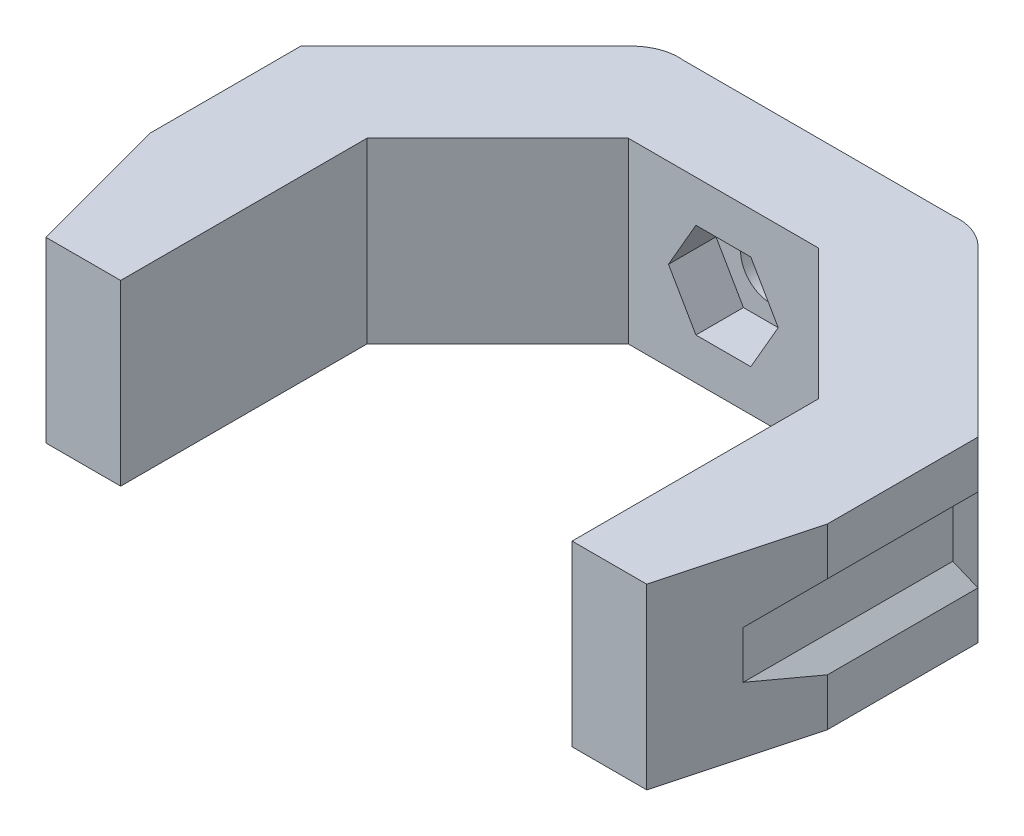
ISO-10303-21;
HEADER;
FILE_DESCRIPTION(('STEP AP214'),'2;1');
FILE_NAME('part.step','',(''),(''),'','','');
FILE_SCHEMA(('AUTOMOTIVE_DESIGN { 1 0 10303 214 1 1 1 1 }'));
ENDSEC;
DATA;
#1=APPLICATION_CONTEXT('core data for automotive mechanical design processes');
#2=APPLICATION_PROTOCOL_DEFINITION('international standard','automotive_design',2000,#1);
#3=PRODUCT_CONTEXT('',#1,'mechanical');
#4=PRODUCT('Part','Part','',(#3));
#5=PRODUCT_RELATED_PRODUCT_CATEGORY('part','',(#4));
#6=PRODUCT_DEFINITION_FORMATION('','',#4);
#7=PRODUCT_DEFINITION_CONTEXT('part definition',#1,'design');
#8=PRODUCT_DEFINITION('design','',#6,#7);
#9=PRODUCT_DEFINITION_SHAPE('','',#8);
#10=(LENGTH_UNIT() NAMED_UNIT(*) SI_UNIT(.MILLI.,.METRE.));
#11=(NAMED_UNIT(*) PLANE_ANGLE_UNIT() SI_UNIT($,.RADIAN.));
#12=(NAMED_UNIT(*) SI_UNIT($,.STERADIAN.) SOLID_ANGLE_UNIT());
#13=UNCERTAINTY_MEASURE_WITH_UNIT(LENGTH_MEASURE(1.E-05),#10,'distance_accuracy_value','');
#14=(GEOMETRIC_REPRESENTATION_CONTEXT(3) GLOBAL_UNCERTAINTY_ASSIGNED_CONTEXT((#13)) GLOBAL_UNIT_ASSIGNED_CONTEXT((#10,
#11,#12)) REPRESENTATION_CONTEXT('',''));
#15=CARTESIAN_POINT('',(0.,0.,0.));
#16=DIRECTION('',(0.,0.,1.));
#17=DIRECTION('',(1.,0.,0.));
#18=AXIS2_PLACEMENT_3D('',#15,#16,#17);
#19=CARTESIAN_POINT('',(46.,15.,0.));
#20=DIRECTION('',(-1.,0.,0.));
#21=DIRECTION('',(0.,0.,1.));
#22=AXIS2_PLACEMENT_3D('',#19,#20,#21);
#23=PLANE('',#22);
#24=DIRECTION('',(0.,-1.,0.));
#25=VECTOR('',#24,1.);
#26=CARTESIAN_POINT('',(46.,-0.001000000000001,-6.40192378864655));
#27=LINE('',#26,#25);
#28=CARTESIAN_POINT('',(46.,9.5,-6.40192378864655));
#29=VERTEX_POINT('',#28);
#30=CARTESIAN_POINT('',(46.,5.5,-6.40192378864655));
#31=VERTEX_POINT('',#30);
#32=EDGE_CURVE('E280',#29,#31,#27,.T.);
#33=ORIENTED_EDGE('',*,*,#32,.T.);
#34=DIRECTION('',(0.,0.,-1.));
#35=VECTOR('',#34,1.);
#36=CARTESIAN_POINT('',(46.,5.5,0.));
#37=LINE('',#36,#35);
#38=CARTESIAN_POINT('',(46.,5.5,-24.0482473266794));
#39=VERTEX_POINT('',#38);
#40=EDGE_CURVE('E743',#31,#39,#37,.T.);
#41=ORIENTED_EDGE('',*,*,#40,.T.);
#42=DIRECTION('',(0.,-1.,0.));
#43=VECTOR('',#42,1.);
#44=CARTESIAN_POINT('',(46.,15.,-24.0482473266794));
#45=LINE('',#44,#43);
#46=CARTESIAN_POINT('',(46.,9.5,-24.0482473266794));
#47=VERTEX_POINT('',#46);
#48=EDGE_CURVE('E522',#47,#39,#45,.T.);
#49=ORIENTED_EDGE('',*,*,#48,.F.);
#50=DIRECTION('',(0.,0.,-1.));
#51=VECTOR('',#50,1.);
#52=CARTESIAN_POINT('',(46.,9.5,0.));
#53=LINE('',#52,#51);
#54=EDGE_CURVE('E303',#29,#47,#53,.T.);
#55=ORIENTED_EDGE('',*,*,#54,.F.);
#56=EDGE_LOOP('',(#33,#41,#49,#55));
#57=FACE_BOUND('',#56,.T.);
#58=ADVANCED_FACE('F43',(#57),#23,.F.);
#59=CARTESIAN_POINT('',(38.,15.,0.));
#60=DIRECTION('',(0.,0.,-1.));
#61=DIRECTION('',(-1.,0.,0.));
#62=AXIS2_PLACEMENT_3D('',#59,#60,#61);
#63=PLANE('',#62);
#64=DIRECTION('',(0.,1.,0.));
#65=VECTOR('',#64,1.);
#66=CARTESIAN_POINT('',(44.2846096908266,-0.001000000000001,0.));
#67=LINE('',#66,#65);
#68=CARTESIAN_POINT('',(44.2846096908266,0.,0.));
#69=VERTEX_POINT('',#68);
#70=CARTESIAN_POINT('',(44.2846096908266,15.,0.));
#71=VERTEX_POINT('',#70);
#72=EDGE_CURVE('E714',#69,#71,#67,.T.);
#73=ORIENTED_EDGE('',*,*,#72,.T.);
#74=DIRECTION('',(1.,0.,0.));
#75=VECTOR('',#74,1.);
#76=CARTESIAN_POINT('',(38.,15.,0.));
#77=LINE('',#76,#75);
#78=CARTESIAN_POINT('',(38.,15.,0.));
#79=VERTEX_POINT('',#78);
#80=EDGE_CURVE('E490',#79,#71,#77,.T.);
#81=ORIENTED_EDGE('',*,*,#80,.F.);
#82=DIRECTION('',(0.,-1.,0.));
#83=VECTOR('',#82,1.);
#84=CARTESIAN_POINT('',(38.,15.,0.));
#85=LINE('',#84,#83);
#86=CARTESIAN_POINT('',(38.,0.,0.));
#87=VERTEX_POINT('',#86);
#88=EDGE_CURVE('E526',#79,#87,#85,.T.);
#89=ORIENTED_EDGE('',*,*,#88,.T.);
#90=DIRECTION('',(1.,0.,0.));
#91=VECTOR('',#90,1.);
#92=CARTESIAN_POINT('',(38.,0.,0.));
#93=LINE('',#92,#91);
#94=EDGE_CURVE('E472',#87,#69,#93,.T.);
#95=ORIENTED_EDGE('',*,*,#94,.T.);
#96=EDGE_LOOP('',(#73,#81,#89,#95));
#97=FACE_BOUND('',#96,.T.);
#98=ADVANCED_FACE('F713',(#97),#63,.F.);
#99=CARTESIAN_POINT('',(0.,15.,0.));
#100=DIRECTION('',(0.,1.,0.));
#101=DIRECTION('',(0.,0.,1.));
#102=AXIS2_PLACEMENT_3D('',#99,#100,#101);
#103=PLANE('',#102);
#104=DIRECTION('',(0.,0.,-1.));
#105=VECTOR('',#104,1.);
#106=CARTESIAN_POINT('',(-9.5,15.,0.));
#107=LINE('',#106,#105);
#108=CARTESIAN_POINT('',(-9.5,15.,-12.));
#109=VERTEX_POINT('',#108);
#110=CARTESIAN_POINT('',(-9.50000000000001,15.,-24.6695676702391));
#111=VERTEX_POINT('',#110);
#112=EDGE_CURVE('E383',#109,#111,#107,.T.);
#113=ORIENTED_EDGE('',*,*,#112,.F.);
#114=DIRECTION('',(-0.258819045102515,0.,-0.96592582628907));
#115=VECTOR('',#114,1.);
#116=CARTESIAN_POINT('',(-9.5,15.,-12.));
#117=LINE('',#116,#115);
#118=CARTESIAN_POINT('',(-6.28460969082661,15.,0.));
#119=VERTEX_POINT('',#118);
#120=EDGE_CURVE('E674',#119,#109,#117,.T.);
#121=ORIENTED_EDGE('',*,*,#120,.F.);
#122=DIRECTION('',(1.,0.,0.));
#123=VECTOR('',#122,1.);
#124=CARTESIAN_POINT('',(-8.,15.,0.));
#125=LINE('',#124,#123);
#126=CARTESIAN_POINT('',(0.,15.,0.));
#127=VERTEX_POINT('',#126);
#128=EDGE_CURVE('E471',#119,#127,#125,.T.);
#129=ORIENTED_EDGE('',*,*,#128,.T.);
#130=DIRECTION('',(0.,0.,-1.));
#131=VECTOR('',#130,1.);
#132=CARTESIAN_POINT('',(0.,15.,0.));
#133=LINE('',#132,#131);
#134=CARTESIAN_POINT('',(0.,15.,-20.7345388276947));
#135=VERTEX_POINT('',#134);
#136=EDGE_CURVE('E475',#127,#135,#133,.T.);
#137=ORIENTED_EDGE('',*,*,#136,.T.);
#138=DIRECTION('',(0.707106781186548,0.,-0.707106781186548));
#139=VECTOR('',#138,1.);
#140=CARTESIAN_POINT('',(0.,15.,-20.7345388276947));
#141=LINE('',#140,#139);
#142=CARTESIAN_POINT('',(11.,15.,-31.7345388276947));
#143=VERTEX_POINT('',#142);
#144=EDGE_CURVE('E478',#135,#143,#141,.T.);
#145=ORIENTED_EDGE('',*,*,#144,.T.);
#146=DIRECTION('',(1.,0.,0.));
#147=VECTOR('',#146,1.);
#148=CARTESIAN_POINT('',(11.,15.,-31.7345388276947));
#149=LINE('',#148,#147);
#150=CARTESIAN_POINT('',(27.,15.,-31.7345388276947));
#151=VERTEX_POINT('',#150);
#152=EDGE_CURVE('E481',#143,#151,#149,.T.);
#153=ORIENTED_EDGE('',*,*,#152,.T.);
#154=DIRECTION('',(0.707106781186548,0.,0.707106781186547));
#155=VECTOR('',#154,1.);
#156=CARTESIAN_POINT('',(27.,15.,-31.7345388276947));
#157=LINE('',#156,#155);
#158=CARTESIAN_POINT('',(38.,15.,-20.7345388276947));
#159=VERTEX_POINT('',#158);
#160=EDGE_CURVE('E484',#151,#159,#157,.T.);
#161=ORIENTED_EDGE('',*,*,#160,.T.);
#162=DIRECTION('',(0.,0.,1.));
#163=VECTOR('',#162,1.);
#164=CARTESIAN_POINT('',(38.,15.,-20.7345388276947));
#165=LINE('',#164,#163);
#166=EDGE_CURVE('E487',#159,#79,#165,.T.);
#167=ORIENTED_EDGE('',*,*,#166,.T.);
#168=ORIENTED_EDGE('',*,*,#80,.T.);
#169=DIRECTION('',(0.258819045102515,0.,-0.96592582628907));
#170=VECTOR('',#169,1.);
#171=CARTESIAN_POINT('',(47.5,15.,-12.));
#172=LINE('',#171,#170);
#173=CARTESIAN_POINT('',(47.5,15.,-12.));
#174=VERTEX_POINT('',#173);
#175=EDGE_CURVE('E296',#71,#174,#172,.T.);
#176=ORIENTED_EDGE('',*,*,#175,.T.);
#177=DIRECTION('',(0.,0.,-1.));
#178=VECTOR('',#177,1.);
#179=CARTESIAN_POINT('',(47.5,15.,0.));
#180=LINE('',#179,#178);
#181=CARTESIAN_POINT('',(47.5,15.,-24.6695676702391));
#182=VERTEX_POINT('',#181);
#183=EDGE_CURVE('E293',#174,#182,#180,.T.);
#184=ORIENTED_EDGE('',*,*,#183,.T.);
#185=DIRECTION('',(-0.707106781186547,0.,-0.707106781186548));
#186=VECTOR('',#185,1.);
#187=CARTESIAN_POINT('',(47.6146446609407,15.,-24.5549230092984));
#188=LINE('',#187,#186);
#189=CARTESIAN_POINT('',(33.5823088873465,15.,-38.5872587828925));
#190=VERTEX_POINT('',#189);
#191=EDGE_CURVE('E313',#182,#190,#188,.T.);
#192=ORIENTED_EDGE('',*,*,#191,.T.);
#193=CARTESIAN_POINT('',(30.7538817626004,15.,-35.7588316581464));
#194=DIRECTION('',(0.,1.,0.));
#195=DIRECTION('',(0.,0.,1.));
#196=AXIS2_PLACEMENT_3D('',#193,#194,#195);
#197=CIRCLE('',#196,4.);
#198=CARTESIAN_POINT('',(30.3137084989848,15.,-39.7345388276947));
#199=VERTEX_POINT('',#198);
#200=EDGE_CURVE('E583',#190,#199,#197,.T.);
#201=ORIENTED_EDGE('',*,*,#200,.T.);
#202=DIRECTION('',(-1.,0.,0.));
#203=VECTOR('',#202,1.);
#204=CARTESIAN_POINT('',(30.3137084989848,15.,-39.7345388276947));
#205=LINE('',#204,#203);
#206=CARTESIAN_POINT('',(7.68629150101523,15.,-39.7345388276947));
#207=VERTEX_POINT('',#206);
#208=EDGE_CURVE('E468',#199,#207,#205,.T.);
#209=ORIENTED_EDGE('',*,*,#208,.T.);
#210=CARTESIAN_POINT('',(7.24611823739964,15.,-35.7588316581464));
#211=DIRECTION('',(0.,1.,0.));
#212=DIRECTION('',(0.,0.,1.));
#213=AXIS2_PLACEMENT_3D('',#210,#211,#212);
#214=CIRCLE('',#213,4.);
#215=CARTESIAN_POINT('',(4.41769111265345,15.,-38.5872587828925));
#216=VERTEX_POINT('',#215);
#217=EDGE_CURVE('E566',#207,#216,#214,.T.);
#218=ORIENTED_EDGE('',*,*,#217,.T.);
#219=DIRECTION('',(0.707106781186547,0.,-0.707106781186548));
#220=VECTOR('',#219,1.);
#221=CARTESIAN_POINT('',(-9.61464466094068,15.,-24.5549230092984));
#222=LINE('',#221,#220);
#223=EDGE_CURVE('E386',#111,#216,#222,.T.);
#224=ORIENTED_EDGE('',*,*,#223,.F.);
#225=EDGE_LOOP('',(#113,#121,#129,#137,#145,#153,#161,#167,#168,#176,#184,#192,#201,#209,#218,#224));
#226=FACE_BOUND('',#225,.T.);
#227=ADVANCED_FACE('F646',(#226),#103,.T.);
#228=CARTESIAN_POINT('',(0.,0.,0.));
#229=DIRECTION('',(0.,1.,0.));
#230=DIRECTION('',(0.,0.,1.));
#231=AXIS2_PLACEMENT_3D('',#228,#229,#230);
#232=PLANE('',#231);
#233=DIRECTION('',(0.,0.,-1.));
#234=VECTOR('',#233,1.);
#235=CARTESIAN_POINT('',(47.5,0.,0.));
#236=LINE('',#235,#234);
#237=CARTESIAN_POINT('',(47.5,0.,-12.));
#238=VERTEX_POINT('',#237);
#239=CARTESIAN_POINT('',(47.5,0.,-24.6695676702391));
#240=VERTEX_POINT('',#239);
#241=EDGE_CURVE('E637',#238,#240,#236,.T.);
#242=ORIENTED_EDGE('',*,*,#241,.F.);
#243=DIRECTION('',(-0.258819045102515,0.,0.96592582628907));
#244=VECTOR('',#243,1.);
#245=CARTESIAN_POINT('',(47.5,0.,-12.));
#246=LINE('',#245,#244);
#247=EDGE_CURVE('E59',#238,#69,#246,.T.);
#248=ORIENTED_EDGE('',*,*,#247,.T.);
#249=ORIENTED_EDGE('',*,*,#94,.F.);
#250=DIRECTION('',(0.,0.,1.));
#251=VECTOR('',#250,1.);
#252=CARTESIAN_POINT('',(38.,0.,-20.7345388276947));
#253=LINE('',#252,#251);
#254=CARTESIAN_POINT('',(38.,0.,-20.7345388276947));
#255=VERTEX_POINT('',#254);
#256=EDGE_CURVE('E513',#255,#87,#253,.T.);
#257=ORIENTED_EDGE('',*,*,#256,.F.);
#258=DIRECTION('',(0.707106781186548,0.,0.707106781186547));
#259=VECTOR('',#258,1.);
#260=CARTESIAN_POINT('',(27.,0.,-31.7345388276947));
#261=LINE('',#260,#259);
#262=CARTESIAN_POINT('',(27.,0.,-31.7345388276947));
#263=VERTEX_POINT('',#262);
#264=EDGE_CURVE('E510',#263,#255,#261,.T.);
#265=ORIENTED_EDGE('',*,*,#264,.F.);
#266=DIRECTION('',(1.,0.,0.));
#267=VECTOR('',#266,1.);
#268=CARTESIAN_POINT('',(11.,0.,-31.7345388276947));
#269=LINE('',#268,#267);
#270=CARTESIAN_POINT('',(11.,0.,-31.7345388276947));
#271=VERTEX_POINT('',#270);
#272=EDGE_CURVE('E507',#271,#263,#269,.T.);
#273=ORIENTED_EDGE('',*,*,#272,.F.);
#274=DIRECTION('',(0.707106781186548,0.,-0.707106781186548));
#275=VECTOR('',#274,1.);
#276=CARTESIAN_POINT('',(0.,0.,-20.7345388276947));
#277=LINE('',#276,#275);
#278=CARTESIAN_POINT('',(0.,0.,-20.7345388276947));
#279=VERTEX_POINT('',#278);
#280=EDGE_CURVE('E504',#279,#271,#277,.T.);
#281=ORIENTED_EDGE('',*,*,#280,.F.);
#282=DIRECTION('',(0.,0.,-1.));
#283=VECTOR('',#282,1.);
#284=CARTESIAN_POINT('',(0.,0.,0.));
#285=LINE('',#284,#283);
#286=CARTESIAN_POINT('',(0.,0.,0.));
#287=VERTEX_POINT('',#286);
#288=EDGE_CURVE('E501',#287,#279,#285,.T.);
#289=ORIENTED_EDGE('',*,*,#288,.F.);
#290=DIRECTION('',(1.,0.,0.));
#291=VECTOR('',#290,1.);
#292=CARTESIAN_POINT('',(-8.,0.,0.));
#293=LINE('',#292,#291);
#294=CARTESIAN_POINT('',(-6.28460969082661,0.,0.));
#295=VERTEX_POINT('',#294);
#296=EDGE_CURVE('E498',#295,#287,#293,.T.);
#297=ORIENTED_EDGE('',*,*,#296,.F.);
#298=DIRECTION('',(0.258819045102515,0.,0.96592582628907));
#299=VECTOR('',#298,1.);
#300=CARTESIAN_POINT('',(-9.5,0.,-12.));
#301=LINE('',#300,#299);
#302=CARTESIAN_POINT('',(-9.5,0.,-12.));
#303=VERTEX_POINT('',#302);
#304=EDGE_CURVE('E622',#303,#295,#301,.T.);
#305=ORIENTED_EDGE('',*,*,#304,.F.);
#306=DIRECTION('',(0.,0.,-1.));
#307=VECTOR('',#306,1.);
#308=CARTESIAN_POINT('',(-9.5,0.,0.));
#309=LINE('',#308,#307);
#310=CARTESIAN_POINT('',(-9.50000000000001,0.,-24.6695676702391));
#311=VERTEX_POINT('',#310);
#312=EDGE_CURVE('E347',#303,#311,#309,.T.);
#313=ORIENTED_EDGE('',*,*,#312,.T.);
#314=DIRECTION('',(0.707106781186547,0.,-0.707106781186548));
#315=VECTOR('',#314,1.);
#316=CARTESIAN_POINT('',(-9.61464466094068,0.,-24.5549230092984));
#317=LINE('',#316,#315);
#318=CARTESIAN_POINT('',(4.41769111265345,0.,-38.5872587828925));
#319=VERTEX_POINT('',#318);
#320=EDGE_CURVE('E359',#311,#319,#317,.T.);
#321=ORIENTED_EDGE('',*,*,#320,.T.);
#322=CARTESIAN_POINT('',(7.24611823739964,0.,-35.7588316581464));
#323=DIRECTION('',(0.,1.,0.));
#324=DIRECTION('',(0.,0.,1.));
#325=AXIS2_PLACEMENT_3D('',#322,#323,#324);
#326=CIRCLE('',#325,4.);
#327=CARTESIAN_POINT('',(7.68629150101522,0.,-39.7345388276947));
#328=VERTEX_POINT('',#327);
#329=EDGE_CURVE('E573',#319,#328,#326,.F.);
#330=ORIENTED_EDGE('',*,*,#329,.T.);
#331=DIRECTION('',(-1.,0.,0.));
#332=VECTOR('',#331,1.);
#333=CARTESIAN_POINT('',(30.3137084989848,0.,-39.7345388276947));
#334=LINE('',#333,#332);
#335=CARTESIAN_POINT('',(30.3137084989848,0.,-39.7345388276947));
#336=VERTEX_POINT('',#335);
#337=EDGE_CURVE('E452',#336,#328,#334,.T.);
#338=ORIENTED_EDGE('',*,*,#337,.F.);
#339=CARTESIAN_POINT('',(30.7538817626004,0.,-35.7588316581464));
#340=DIRECTION('',(0.,1.,0.));
#341=DIRECTION('',(0.,0.,1.));
#342=AXIS2_PLACEMENT_3D('',#339,#340,#341);
#343=CIRCLE('',#342,4.);
#344=CARTESIAN_POINT('',(33.5823088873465,0.,-38.5872587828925));
#345=VERTEX_POINT('',#344);
#346=EDGE_CURVE('E11',#336,#345,#343,.F.);
#347=ORIENTED_EDGE('',*,*,#346,.T.);
#348=DIRECTION('',(-0.707106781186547,0.,-0.707106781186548));
#349=VECTOR('',#348,1.);
#350=CARTESIAN_POINT('',(47.6146446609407,0.,-24.5549230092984));
#351=LINE('',#350,#349);
#352=EDGE_CURVE('E633',#240,#345,#351,.T.);
#353=ORIENTED_EDGE('',*,*,#352,.F.);
#354=EDGE_LOOP('',(#242,#248,#249,#257,#265,#273,#281,#289,#297,#305,#313,#321,#330,#338,#347,#353));
#355=FACE_BOUND('',#354,.T.);
#356=ADVANCED_FACE('F761',(#355),#232,.F.);
#357=CARTESIAN_POINT('',(47.5,15.,0.));
#358=DIRECTION('',(-1.,0.,0.));
#359=DIRECTION('',(0.,0.,1.));
#360=AXIS2_PLACEMENT_3D('',#357,#358,#359);
#361=PLANE('',#360);
#362=DIRECTION('',(0.,1.,0.));
#363=VECTOR('',#362,1.);
#364=CARTESIAN_POINT('',(47.5,-0.001000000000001,-12.));
#365=LINE('',#364,#363);
#366=CARTESIAN_POINT('',(47.5,11.,-12.));
#367=VERTEX_POINT('',#366);
#368=EDGE_CURVE('E277',#367,#174,#365,.T.);
#369=ORIENTED_EDGE('',*,*,#368,.F.);
#370=DIRECTION('',(0.,0.,-1.));
#371=VECTOR('',#370,1.);
#372=CARTESIAN_POINT('',(47.5,11.,0.));
#373=LINE('',#372,#371);
#374=CARTESIAN_POINT('',(47.5,11.,-24.6695676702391));
#375=VERTEX_POINT('',#374);
#376=EDGE_CURVE('E291',#367,#375,#373,.T.);
#377=ORIENTED_EDGE('',*,*,#376,.T.);
#378=DIRECTION('',(0.,-1.,0.));
#379=VECTOR('',#378,1.);
#380=CARTESIAN_POINT('',(47.5,15.,-24.6695676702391));
#381=LINE('',#380,#379);
#382=EDGE_CURVE('E640',#182,#375,#381,.T.);
#383=ORIENTED_EDGE('',*,*,#382,.F.);
#384=ORIENTED_EDGE('',*,*,#183,.F.);
#385=EDGE_LOOP('',(#369,#377,#383,#384));
#386=FACE_BOUND('',#385,.T.);
#387=ADVANCED_FACE('F289',(#386),#361,.F.);
#388=CARTESIAN_POINT('',(46.,9.5,0.));
#389=DIRECTION('',(-0.707106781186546,0.707106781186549,0.));
#390=DIRECTION('',(-0.707106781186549,-0.707106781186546,0.));
#391=AXIS2_PLACEMENT_3D('',#388,#389,#390);
#392=PLANE('',#391);
#393=DIRECTION('',(-0.250562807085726,-0.250562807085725,0.935113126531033));
#394=VECTOR('',#393,1.);
#395=CARTESIAN_POINT('',(46.8093382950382,10.3093382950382,-9.42241542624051));
#396=LINE('',#395,#394);
#397=EDGE_CURVE('E274',#367,#29,#396,.T.);
#398=ORIENTED_EDGE('',*,*,#397,.T.);
#399=ORIENTED_EDGE('',*,*,#54,.T.);
#400=DIRECTION('',(-0.678598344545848,-0.678598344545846,0.281084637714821));
#401=VECTOR('',#400,1.);
#402=CARTESIAN_POINT('',(41.4129514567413,4.91295145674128,-22.1482296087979));
#403=LINE('',#402,#401);
#404=EDGE_CURVE('E300',#375,#47,#403,.T.);
#405=ORIENTED_EDGE('',*,*,#404,.F.);
#406=ORIENTED_EDGE('',*,*,#376,.F.);
#407=EDGE_LOOP('',(#398,#399,#405,#406));
#408=FACE_BOUND('',#407,.T.);
#409=ADVANCED_FACE('F298',(#408),#392,.F.);
#410=CARTESIAN_POINT('',(46.,5.5,0.));
#411=DIRECTION('',(-0.707106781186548,-0.707106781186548,0.));
#412=DIRECTION('',(0.707106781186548,-0.707106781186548,0.));
#413=AXIS2_PLACEMENT_3D('',#410,#411,#412);
#414=PLANE('',#413);
#415=DIRECTION('',(0.250562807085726,-0.250562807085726,-0.935113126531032));
#416=VECTOR('',#415,1.);
#417=CARTESIAN_POINT('',(47.751189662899,3.74881033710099,-12.9374525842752));
#418=LINE('',#417,#416);
#419=CARTESIAN_POINT('',(47.5,4.,-12.));
#420=VERTEX_POINT('',#419);
#421=EDGE_CURVE('E285',#31,#420,#418,.T.);
#422=ORIENTED_EDGE('',*,*,#421,.T.);
#423=DIRECTION('',(0.,0.,-1.));
#424=VECTOR('',#423,1.);
#425=CARTESIAN_POINT('',(47.5,4.,0.));
#426=LINE('',#425,#424);
#427=CARTESIAN_POINT('',(47.5,4.,-24.6695676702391));
#428=VERTEX_POINT('',#427);
#429=EDGE_CURVE('E740',#420,#428,#426,.T.);
#430=ORIENTED_EDGE('',*,*,#429,.T.);
#431=DIRECTION('',(0.678598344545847,-0.678598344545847,-0.28108463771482));
#432=VECTOR('',#431,1.);
#433=CARTESIAN_POINT('',(41.4129514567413,10.0870485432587,-22.1482296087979));
#434=LINE('',#433,#432);
#435=EDGE_CURVE('E318',#39,#428,#434,.T.);
#436=ORIENTED_EDGE('',*,*,#435,.F.);
#437=ORIENTED_EDGE('',*,*,#40,.F.);
#438=EDGE_LOOP('',(#422,#430,#436,#437));
#439=FACE_BOUND('',#438,.T.);
#440=ADVANCED_FACE('F855',(#439),#414,.F.);
#441=CARTESIAN_POINT('',(47.5,0.,0.));
#442=DIRECTION('',(-1.,0.,0.));
#443=DIRECTION('',(0.,0.,1.));
#444=AXIS2_PLACEMENT_3D('',#441,#442,#443);
#445=PLANE('',#444);
#446=EDGE_CURVE('E295',#238,#420,#365,.T.);
#447=ORIENTED_EDGE('',*,*,#446,.F.);
#448=ORIENTED_EDGE('',*,*,#241,.T.);
#449=DIRECTION('',(0.,-1.,0.));
#450=VECTOR('',#449,1.);
#451=CARTESIAN_POINT('',(47.5,0.,-24.6695676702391));
#452=LINE('',#451,#450);
#453=EDGE_CURVE('E628',#428,#240,#452,.T.);
#454=ORIENTED_EDGE('',*,*,#453,.F.);
#455=ORIENTED_EDGE('',*,*,#429,.F.);
#456=EDGE_LOOP('',(#447,#448,#454,#455));
#457=FACE_BOUND('',#456,.T.);
#458=ADVANCED_FACE('F757',(#457),#445,.F.);
#459=CARTESIAN_POINT('',(46.,15.,-24.0482473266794));
#460=DIRECTION('',(-0.707106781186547,0.,0.707106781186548));
#461=DIRECTION('',(0.707106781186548,0.,0.707106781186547));
#462=AXIS2_PLACEMENT_3D('',#459,#460,#461);
#463=PLANE('',#462);
#464=ORIENTED_EDGE('',*,*,#48,.T.);
#465=DIRECTION('',(-0.707106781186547,0.,-0.707106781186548));
#466=VECTOR('',#465,1.);
#467=CARTESIAN_POINT('',(46.5539844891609,5.5,-23.4942628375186));
#468=LINE('',#467,#466);
#469=CARTESIAN_POINT('',(30.3137084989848,5.50000000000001,-39.7345388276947));
#470=VERTEX_POINT('',#469);
#471=EDGE_CURVE('E599',#39,#470,#468,.T.);
#472=ORIENTED_EDGE('',*,*,#471,.T.);
#473=DIRECTION('',(0.,-1.,0.));
#474=VECTOR('',#473,1.);
#475=CARTESIAN_POINT('',(30.3137084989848,15.,-39.7345388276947));
#476=LINE('',#475,#474);
#477=CARTESIAN_POINT('',(30.3137084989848,9.5,-39.7345388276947));
#478=VERTEX_POINT('',#477);
#479=EDGE_CURVE('E494',#478,#470,#476,.T.);
#480=ORIENTED_EDGE('',*,*,#479,.F.);
#481=DIRECTION('',(-0.707106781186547,0.,-0.707106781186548));
#482=VECTOR('',#481,1.);
#483=CARTESIAN_POINT('',(46.5539844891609,9.5,-23.4942628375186));
#484=LINE('',#483,#482);
#485=EDGE_CURVE('E309',#47,#478,#484,.T.);
#486=ORIENTED_EDGE('',*,*,#485,.F.);
#487=EDGE_LOOP('',(#464,#472,#480,#486));
#488=FACE_BOUND('',#487,.T.);
#489=ADVANCED_FACE('F608',(#488),#463,.F.);
#490=CARTESIAN_POINT('',(7.68629150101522,15.,-39.7345388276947));
#491=DIRECTION('',(0.707106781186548,0.,0.707106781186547));
#492=DIRECTION('',(0.707106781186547,0.,-0.707106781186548));
#493=AXIS2_PLACEMENT_3D('',#490,#491,#492);
#494=PLANE('',#493);
#495=DIRECTION('',(0.707106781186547,0.,-0.707106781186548));
#496=VECTOR('',#495,1.);
#497=CARTESIAN_POINT('',(-8.55398448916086,5.5,-23.4942628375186));
#498=LINE('',#497,#496);
#499=CARTESIAN_POINT('',(-8.,5.5,-24.0482473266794));
#500=VERTEX_POINT('',#499);
#501=CARTESIAN_POINT('',(7.68629150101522,5.50000000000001,-39.7345388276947));
#502=VERTEX_POINT('',#501);
#503=EDGE_CURVE('E352',#500,#502,#498,.T.);
#504=ORIENTED_EDGE('',*,*,#503,.F.);
#505=DIRECTION('',(0.,-1.,0.));
#506=VECTOR('',#505,1.);
#507=CARTESIAN_POINT('',(-8.,15.,-24.0482473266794));
#508=LINE('',#507,#506);
#509=CARTESIAN_POINT('',(-8.,9.5,-24.0482473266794));
#510=VERTEX_POINT('',#509);
#511=EDGE_CURVE('E550',#510,#500,#508,.T.);
#512=ORIENTED_EDGE('',*,*,#511,.F.);
#513=DIRECTION('',(0.707106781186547,0.,-0.707106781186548));
#514=VECTOR('',#513,1.);
#515=CARTESIAN_POINT('',(-8.55398448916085,9.5,-23.4942628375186));
#516=LINE('',#515,#514);
#517=CARTESIAN_POINT('',(7.68629150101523,9.5,-39.7345388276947));
#518=VERTEX_POINT('',#517);
#519=EDGE_CURVE('E338',#510,#518,#516,.T.);
#520=ORIENTED_EDGE('',*,*,#519,.T.);
#521=DIRECTION('',(0.,-1.,0.));
#522=VECTOR('',#521,1.);
#523=CARTESIAN_POINT('',(7.68629150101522,15.,-39.7345388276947));
#524=LINE('',#523,#522);
#525=EDGE_CURVE('E554',#518,#502,#524,.T.);
#526=ORIENTED_EDGE('',*,*,#525,.T.);
#527=EDGE_LOOP('',(#504,#512,#520,#526));
#528=FACE_BOUND('',#527,.T.);
#529=ADVANCED_FACE('F790',(#528),#494,.F.);
#530=CARTESIAN_POINT('',(-8.,15.,-24.0482473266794));
#531=DIRECTION('',(1.,0.,0.));
#532=DIRECTION('',(0.,0.,-1.));
#533=AXIS2_PLACEMENT_3D('',#530,#531,#532);
#534=PLANE('',#533);
#535=DIRECTION('',(0.,0.,-1.));
#536=VECTOR('',#535,1.);
#537=CARTESIAN_POINT('',(-8.,5.5,0.));
#538=LINE('',#537,#536);
#539=CARTESIAN_POINT('',(-8.,5.5,-6.40192378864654));
#540=VERTEX_POINT('',#539);
#541=EDGE_CURVE('E348',#540,#500,#538,.T.);
#542=ORIENTED_EDGE('',*,*,#541,.F.);
#543=DIRECTION('',(0.,-1.,0.));
#544=VECTOR('',#543,1.);
#545=CARTESIAN_POINT('',(-8.,-0.001000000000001,-6.40192378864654));
#546=LINE('',#545,#544);
#547=CARTESIAN_POINT('',(-8.,9.5,-6.40192378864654));
#548=VERTEX_POINT('',#547);
#549=EDGE_CURVE('E67',#548,#540,#546,.T.);
#550=ORIENTED_EDGE('',*,*,#549,.F.);
#551=DIRECTION('',(0.,0.,-1.));
#552=VECTOR('',#551,1.);
#553=CARTESIAN_POINT('',(-8.,9.5,0.));
#554=LINE('',#553,#552);
#555=EDGE_CURVE('E382',#548,#510,#554,.T.);
#556=ORIENTED_EDGE('',*,*,#555,.T.);
#557=ORIENTED_EDGE('',*,*,#511,.T.);
#558=EDGE_LOOP('',(#542,#550,#556,#557));
#559=FACE_BOUND('',#558,.T.);
#560=ADVANCED_FACE('F786',(#559),#534,.F.);
#561=CARTESIAN_POINT('',(30.3137084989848,15.,-39.7345388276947));
#562=DIRECTION('',(0.,0.,1.));
#563=DIRECTION('',(1.,0.,0.));
#564=AXIS2_PLACEMENT_3D('',#561,#562,#563);
#565=PLANE('',#564);
#566=CARTESIAN_POINT('',(19.,7.5,-39.7345388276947));
#567=DIRECTION('',(0.,0.,1.));
#568=DIRECTION('',(1.,0.,0.));
#569=AXIS2_PLACEMENT_3D('',#566,#567,#568);
#570=CIRCLE('',#569,2.55);
#571=CARTESIAN_POINT('',(21.55,7.5,-39.7345388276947));
#572=VERTEX_POINT('',#571);
#573=EDGE_CURVE('E329',#572,#572,#570,.F.);
#574=ORIENTED_EDGE('',*,*,#573,.F.);
#575=EDGE_LOOP('',(#574));
#576=FACE_BOUND('',#575,.T.);
#577=ORIENTED_EDGE('',*,*,#337,.T.);
#578=DIRECTION('',(0.,1.,0.));
#579=VECTOR('',#578,1.);
#580=CARTESIAN_POINT('',(7.68629150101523,0.,-39.7345388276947));
#581=LINE('',#580,#579);
#582=EDGE_CURVE('E333',#328,#502,#581,.T.);
#583=ORIENTED_EDGE('',*,*,#582,.T.);
#584=ORIENTED_EDGE('',*,*,#525,.F.);
#585=EDGE_CURVE('E555',#207,#518,#524,.T.);
#586=ORIENTED_EDGE('',*,*,#585,.F.);
#587=ORIENTED_EDGE('',*,*,#208,.F.);
#588=EDGE_CURVE('E519',#199,#478,#476,.T.);
#589=ORIENTED_EDGE('',*,*,#588,.T.);
#590=ORIENTED_EDGE('',*,*,#479,.T.);
#591=DIRECTION('',(0.,1.,0.));
#592=VECTOR('',#591,1.);
#593=CARTESIAN_POINT('',(30.3137084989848,0.,-39.7345388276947));
#594=LINE('',#593,#592);
#595=EDGE_CURVE('E612',#470,#336,#594,.F.);
#596=ORIENTED_EDGE('',*,*,#595,.T.);
#597=EDGE_LOOP('',(#577,#583,#584,#586,#587,#589,#590,#596));
#598=FACE_BOUND('',#597,.T.);
#599=ADVANCED_FACE('F615',(#576,#598),#565,.F.);
#600=CARTESIAN_POINT('',(-8.,15.,0.));
#601=DIRECTION('',(0.,0.,-1.));
#602=DIRECTION('',(-1.,0.,0.));
#603=AXIS2_PLACEMENT_3D('',#600,#601,#602);
#604=PLANE('',#603);
#605=ORIENTED_EDGE('',*,*,#128,.F.);
#606=DIRECTION('',(0.,1.,0.));
#607=VECTOR('',#606,1.);
#608=CARTESIAN_POINT('',(-6.28460969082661,-0.001000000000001,0.));
#609=LINE('',#608,#607);
#610=EDGE_CURVE('E678',#295,#119,#609,.T.);
#611=ORIENTED_EDGE('',*,*,#610,.F.);
#612=ORIENTED_EDGE('',*,*,#296,.T.);
#613=DIRECTION('',(0.,-1.,0.));
#614=VECTOR('',#613,1.);
#615=CARTESIAN_POINT('',(0.,15.,0.));
#616=LINE('',#615,#614);
#617=EDGE_CURVE('E546',#127,#287,#616,.T.);
#618=ORIENTED_EDGE('',*,*,#617,.F.);
#619=EDGE_LOOP('',(#605,#611,#612,#618));
#620=FACE_BOUND('',#619,.T.);
#621=ADVANCED_FACE('F682',(#620),#604,.F.);
#622=CARTESIAN_POINT('',(0.,15.,0.));
#623=DIRECTION('',(-1.,0.,0.));
#624=DIRECTION('',(0.,0.,1.));
#625=AXIS2_PLACEMENT_3D('',#622,#623,#624);
#626=PLANE('',#625);
#627=ORIENTED_EDGE('',*,*,#288,.T.);
#628=DIRECTION('',(0.,-1.,0.));
#629=VECTOR('',#628,1.);
#630=CARTESIAN_POINT('',(0.,15.,-20.7345388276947));
#631=LINE('',#630,#629);
#632=EDGE_CURVE('E542',#135,#279,#631,.T.);
#633=ORIENTED_EDGE('',*,*,#632,.F.);
#634=ORIENTED_EDGE('',*,*,#136,.F.);
#635=ORIENTED_EDGE('',*,*,#617,.T.);
#636=EDGE_LOOP('',(#627,#633,#634,#635));
#637=FACE_BOUND('',#636,.T.);
#638=ADVANCED_FACE('F688',(#637),#626,.F.);
#639=CARTESIAN_POINT('',(0.,15.,-20.7345388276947));
#640=DIRECTION('',(-0.707106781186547,0.,-0.707106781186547));
#641=DIRECTION('',(-0.707106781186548,0.,0.707106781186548));
#642=AXIS2_PLACEMENT_3D('',#639,#640,#641);
#643=PLANE('',#642);
#644=ORIENTED_EDGE('',*,*,#280,.T.);
#645=DIRECTION('',(0.,-1.,0.));
#646=VECTOR('',#645,1.);
#647=CARTESIAN_POINT('',(11.,15.,-31.7345388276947));
#648=LINE('',#647,#646);
#649=EDGE_CURVE('E538',#143,#271,#648,.T.);
#650=ORIENTED_EDGE('',*,*,#649,.F.);
#651=ORIENTED_EDGE('',*,*,#144,.F.);
#652=ORIENTED_EDGE('',*,*,#632,.T.);
#653=EDGE_LOOP('',(#644,#650,#651,#652));
#654=FACE_BOUND('',#653,.T.);
#655=ADVANCED_FACE('F694',(#654),#643,.F.);
#656=CARTESIAN_POINT('',(11.,15.,-31.7345388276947));
#657=DIRECTION('',(0.,0.,-1.));
#658=DIRECTION('',(-1.,0.,0.));
#659=AXIS2_PLACEMENT_3D('',#656,#657,#658);
#660=PLANE('',#659);
#661=DIRECTION('',(-1.,0.,0.));
#662=VECTOR('',#661,1.);
#663=CARTESIAN_POINT('',(21.3094010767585,11.5,-31.7345388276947));
#664=LINE('',#663,#662);
#665=CARTESIAN_POINT('',(21.3094010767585,11.5,-31.7345388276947));
#666=VERTEX_POINT('',#665);
#667=CARTESIAN_POINT('',(16.6905989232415,11.5,-31.7345388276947));
#668=VERTEX_POINT('',#667);
#669=EDGE_CURVE('E430',#666,#668,#664,.T.);
#670=ORIENTED_EDGE('',*,*,#669,.F.);
#671=DIRECTION('',(-0.5,0.866025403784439,0.));
#672=VECTOR('',#671,1.);
#673=CARTESIAN_POINT('',(23.618802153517,7.5,-31.7345388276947));
#674=LINE('',#673,#672);
#675=CARTESIAN_POINT('',(23.618802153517,7.5,-31.7345388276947));
#676=VERTEX_POINT('',#675);
#677=EDGE_CURVE('E374',#676,#666,#674,.T.);
#678=ORIENTED_EDGE('',*,*,#677,.F.);
#679=DIRECTION('',(0.5,0.866025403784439,0.));
#680=VECTOR('',#679,1.);
#681=CARTESIAN_POINT('',(21.3094010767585,3.5,-31.7345388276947));
#682=LINE('',#681,#680);
#683=CARTESIAN_POINT('',(21.3094010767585,3.5,-31.7345388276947));
#684=VERTEX_POINT('',#683);
#685=EDGE_CURVE('E407',#684,#676,#682,.T.);
#686=ORIENTED_EDGE('',*,*,#685,.F.);
#687=DIRECTION('',(1.,0.,0.));
#688=VECTOR('',#687,1.);
#689=CARTESIAN_POINT('',(16.6905989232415,3.5,-31.7345388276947));
#690=LINE('',#689,#688);
#691=CARTESIAN_POINT('',(16.6905989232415,3.5,-31.7345388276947));
#692=VERTEX_POINT('',#691);
#693=EDGE_CURVE('E442',#692,#684,#690,.T.);
#694=ORIENTED_EDGE('',*,*,#693,.F.);
#695=DIRECTION('',(0.5,-0.866025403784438,0.));
#696=VECTOR('',#695,1.);
#697=CARTESIAN_POINT('',(14.381197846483,7.5,-31.7345388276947));
#698=LINE('',#697,#696);
#699=CARTESIAN_POINT('',(14.381197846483,7.5,-31.7345388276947));
#700=VERTEX_POINT('',#699);
#701=EDGE_CURVE('E438',#700,#692,#698,.T.);
#702=ORIENTED_EDGE('',*,*,#701,.F.);
#703=DIRECTION('',(-0.5,-0.866025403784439,0.));
#704=VECTOR('',#703,1.);
#705=CARTESIAN_POINT('',(16.6905989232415,11.5,-31.7345388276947));
#706=LINE('',#705,#704);
#707=EDGE_CURVE('E434',#668,#700,#706,.T.);
#708=ORIENTED_EDGE('',*,*,#707,.F.);
#709=EDGE_LOOP('',(#670,#678,#686,#694,#702,#708));
#710=FACE_BOUND('',#709,.T.);
#711=ORIENTED_EDGE('',*,*,#272,.T.);
#712=DIRECTION('',(0.,-1.,0.));
#713=VECTOR('',#712,1.);
#714=CARTESIAN_POINT('',(27.,15.,-31.7345388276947));
#715=LINE('',#714,#713);
#716=EDGE_CURVE('E534',#151,#263,#715,.T.);
#717=ORIENTED_EDGE('',*,*,#716,.F.);
#718=ORIENTED_EDGE('',*,*,#152,.F.);
#719=ORIENTED_EDGE('',*,*,#649,.T.);
#720=EDGE_LOOP('',(#711,#717,#718,#719));
#721=FACE_BOUND('',#720,.T.);
#722=ADVANCED_FACE('F698',(#710,#721),#660,.F.);
#723=CARTESIAN_POINT('',(27.,15.,-31.7345388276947));
#724=DIRECTION('',(0.707106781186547,0.,-0.707106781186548));
#725=DIRECTION('',(-0.707106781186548,0.,-0.707106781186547));
#726=AXIS2_PLACEMENT_3D('',#723,#724,#725);
#727=PLANE('',#726);
#728=ORIENTED_EDGE('',*,*,#264,.T.);
#729=DIRECTION('',(0.,-1.,0.));
#730=VECTOR('',#729,1.);
#731=CARTESIAN_POINT('',(38.,15.,-20.7345388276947));
#732=LINE('',#731,#730);
#733=EDGE_CURVE('E530',#159,#255,#732,.T.);
#734=ORIENTED_EDGE('',*,*,#733,.F.);
#735=ORIENTED_EDGE('',*,*,#160,.F.);
#736=ORIENTED_EDGE('',*,*,#716,.T.);
#737=EDGE_LOOP('',(#728,#734,#735,#736));
#738=FACE_BOUND('',#737,.T.);
#739=ADVANCED_FACE('F703',(#738),#727,.F.);
#740=CARTESIAN_POINT('',(38.,15.,-20.7345388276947));
#741=DIRECTION('',(1.,0.,0.));
#742=DIRECTION('',(0.,0.,-1.));
#743=AXIS2_PLACEMENT_3D('',#740,#741,#742);
#744=PLANE('',#743);
#745=ORIENTED_EDGE('',*,*,#256,.T.);
#746=ORIENTED_EDGE('',*,*,#88,.F.);
#747=ORIENTED_EDGE('',*,*,#166,.F.);
#748=ORIENTED_EDGE('',*,*,#733,.T.);
#749=EDGE_LOOP('',(#745,#746,#747,#748));
#750=FACE_BOUND('',#749,.T.);
#751=ADVANCED_FACE('F708',(#750),#744,.F.);
#752=CARTESIAN_POINT('',(23.618802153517,7.5,-35.7345388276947));
#753=DIRECTION('',(0.866025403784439,0.5,0.));
#754=DIRECTION('',(-0.5,0.866025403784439,0.));
#755=AXIS2_PLACEMENT_3D('',#752,#753,#754);
#756=PLANE('',#755);
#757=ORIENTED_EDGE('',*,*,#677,.T.);
#758=DIRECTION('',(0.,0.,1.));
#759=VECTOR('',#758,1.);
#760=CARTESIAN_POINT('',(21.3094010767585,11.5,-35.7345388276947));
#761=LINE('',#760,#759);
#762=CARTESIAN_POINT('',(21.3094010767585,11.5,-35.7345388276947));
#763=VERTEX_POINT('',#762);
#764=EDGE_CURVE('E427',#763,#666,#761,.T.);
#765=ORIENTED_EDGE('',*,*,#764,.F.);
#766=DIRECTION('',(-0.5,0.866025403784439,0.));
#767=VECTOR('',#766,1.);
#768=CARTESIAN_POINT('',(23.618802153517,7.5,-35.7345388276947));
#769=LINE('',#768,#767);
#770=CARTESIAN_POINT('',(23.618802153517,7.5,-35.7345388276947));
#771=VERTEX_POINT('',#770);
#772=EDGE_CURVE('E402',#771,#763,#769,.T.);
#773=ORIENTED_EDGE('',*,*,#772,.F.);
#774=DIRECTION('',(0.,0.,1.));
#775=VECTOR('',#774,1.);
#776=CARTESIAN_POINT('',(23.618802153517,7.5,-35.7345388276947));
#777=LINE('',#776,#775);
#778=EDGE_CURVE('E449',#771,#676,#777,.T.);
#779=ORIENTED_EDGE('',*,*,#778,.T.);
#780=EDGE_LOOP('',(#757,#765,#773,#779));
#781=FACE_BOUND('',#780,.T.);
#782=ADVANCED_FACE('F819',(#781),#756,.F.);
#783=CARTESIAN_POINT('',(21.3094010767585,3.5,-35.7345388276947));
#784=DIRECTION('',(0.866025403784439,-0.5,0.));
#785=DIRECTION('',(0.5,0.866025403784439,0.));
#786=AXIS2_PLACEMENT_3D('',#783,#784,#785);
#787=PLANE('',#786);
#788=ORIENTED_EDGE('',*,*,#685,.T.);
#789=ORIENTED_EDGE('',*,*,#778,.F.);
#790=DIRECTION('',(0.5,0.866025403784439,0.));
#791=VECTOR('',#790,1.);
#792=CARTESIAN_POINT('',(21.3094010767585,3.5,-35.7345388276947));
#793=LINE('',#792,#791);
#794=CARTESIAN_POINT('',(21.3094010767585,3.5,-35.7345388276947));
#795=VERTEX_POINT('',#794);
#796=EDGE_CURVE('E423',#795,#771,#793,.T.);
#797=ORIENTED_EDGE('',*,*,#796,.F.);
#798=DIRECTION('',(0.,0.,1.));
#799=VECTOR('',#798,1.);
#800=CARTESIAN_POINT('',(21.3094010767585,3.5,-35.7345388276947));
#801=LINE('',#800,#799);
#802=EDGE_CURVE('E453',#795,#684,#801,.T.);
#803=ORIENTED_EDGE('',*,*,#802,.T.);
#804=EDGE_LOOP('',(#788,#789,#797,#803));
#805=FACE_BOUND('',#804,.T.);
#806=ADVANCED_FACE('F888',(#805),#787,.F.);
#807=CARTESIAN_POINT('',(16.6905989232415,3.5,-35.7345388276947));
#808=DIRECTION('',(0.,-1.,0.));
#809=DIRECTION('',(0.,0.,-1.));
#810=AXIS2_PLACEMENT_3D('',#807,#808,#809);
#811=PLANE('',#810);
#812=ORIENTED_EDGE('',*,*,#693,.T.);
#813=ORIENTED_EDGE('',*,*,#802,.F.);
#814=DIRECTION('',(1.,0.,0.));
#815=VECTOR('',#814,1.);
#816=CARTESIAN_POINT('',(16.6905989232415,3.5,-35.7345388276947));
#817=LINE('',#816,#815);
#818=CARTESIAN_POINT('',(16.6905989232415,3.5,-35.7345388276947));
#819=VERTEX_POINT('',#818);
#820=EDGE_CURVE('E419',#819,#795,#817,.T.);
#821=ORIENTED_EDGE('',*,*,#820,.F.);
#822=DIRECTION('',(0.,0.,1.));
#823=VECTOR('',#822,1.);
#824=CARTESIAN_POINT('',(16.6905989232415,3.5,-35.7345388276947));
#825=LINE('',#824,#823);
#826=EDGE_CURVE('E456',#819,#692,#825,.T.);
#827=ORIENTED_EDGE('',*,*,#826,.T.);
#828=EDGE_LOOP('',(#812,#813,#821,#827));
#829=FACE_BOUND('',#828,.T.);
#830=ADVANCED_FACE('F891',(#829),#811,.F.);
#831=CARTESIAN_POINT('',(14.381197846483,7.5,-35.7345388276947));
#832=DIRECTION('',(-0.866025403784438,-0.5,0.));
#833=DIRECTION('',(0.5,-0.866025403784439,0.));
#834=AXIS2_PLACEMENT_3D('',#831,#832,#833);
#835=PLANE('',#834);
#836=ORIENTED_EDGE('',*,*,#701,.T.);
#837=ORIENTED_EDGE('',*,*,#826,.F.);
#838=DIRECTION('',(0.5,-0.866025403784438,0.));
#839=VECTOR('',#838,1.);
#840=CARTESIAN_POINT('',(14.381197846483,7.5,-35.7345388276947));
#841=LINE('',#840,#839);
#842=CARTESIAN_POINT('',(14.381197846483,7.5,-35.7345388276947));
#843=VERTEX_POINT('',#842);
#844=EDGE_CURVE('E415',#843,#819,#841,.T.);
#845=ORIENTED_EDGE('',*,*,#844,.F.);
#846=DIRECTION('',(0.,0.,1.));
#847=VECTOR('',#846,1.);
#848=CARTESIAN_POINT('',(14.381197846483,7.5,-35.7345388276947));
#849=LINE('',#848,#847);
#850=EDGE_CURVE('E459',#843,#700,#849,.T.);
#851=ORIENTED_EDGE('',*,*,#850,.T.);
#852=EDGE_LOOP('',(#836,#837,#845,#851));
#853=FACE_BOUND('',#852,.T.);
#854=ADVANCED_FACE('F895',(#853),#835,.F.);
#855=CARTESIAN_POINT('',(16.6905989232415,11.5,-35.7345388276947));
#856=DIRECTION('',(-0.866025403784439,0.5,0.));
#857=DIRECTION('',(-0.5,-0.866025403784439,0.));
#858=AXIS2_PLACEMENT_3D('',#855,#856,#857);
#859=PLANE('',#858);
#860=ORIENTED_EDGE('',*,*,#707,.T.);
#861=ORIENTED_EDGE('',*,*,#850,.F.);
#862=DIRECTION('',(-0.5,-0.866025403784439,0.));
#863=VECTOR('',#862,1.);
#864=CARTESIAN_POINT('',(16.6905989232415,11.5,-35.7345388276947));
#865=LINE('',#864,#863);
#866=CARTESIAN_POINT('',(16.6905989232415,11.5,-35.7345388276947));
#867=VERTEX_POINT('',#866);
#868=EDGE_CURVE('E411',#867,#843,#865,.T.);
#869=ORIENTED_EDGE('',*,*,#868,.F.);
#870=DIRECTION('',(0.,0.,1.));
#871=VECTOR('',#870,1.);
#872=CARTESIAN_POINT('',(16.6905989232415,11.5,-35.7345388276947));
#873=LINE('',#872,#871);
#874=EDGE_CURVE('E462',#867,#668,#873,.T.);
#875=ORIENTED_EDGE('',*,*,#874,.T.);
#876=EDGE_LOOP('',(#860,#861,#869,#875));
#877=FACE_BOUND('',#876,.T.);
#878=ADVANCED_FACE('F899',(#877),#859,.F.);
#879=CARTESIAN_POINT('',(21.3094010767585,11.5,-35.7345388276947));
#880=DIRECTION('',(0.,1.,0.));
#881=DIRECTION('',(0.,0.,1.));
#882=AXIS2_PLACEMENT_3D('',#879,#880,#881);
#883=PLANE('',#882);
#884=ORIENTED_EDGE('',*,*,#669,.T.);
#885=ORIENTED_EDGE('',*,*,#874,.F.);
#886=DIRECTION('',(-1.,0.,0.));
#887=VECTOR('',#886,1.);
#888=CARTESIAN_POINT('',(21.3094010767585,11.5,-35.7345388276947));
#889=LINE('',#888,#887);
#890=EDGE_CURVE('E406',#763,#867,#889,.T.);
#891=ORIENTED_EDGE('',*,*,#890,.F.);
#892=ORIENTED_EDGE('',*,*,#764,.T.);
#893=EDGE_LOOP('',(#884,#885,#891,#892));
#894=FACE_BOUND('',#893,.T.);
#895=ADVANCED_FACE('F886',(#894),#883,.F.);
#896=CARTESIAN_POINT('',(0.,0.,-35.7345388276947));
#897=DIRECTION('',(0.,0.,1.));
#898=DIRECTION('',(1.,0.,0.));
#899=AXIS2_PLACEMENT_3D('',#896,#897,#898);
#900=PLANE('',#899);
#901=CARTESIAN_POINT('',(19.,7.5,-35.7345388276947));
#902=DIRECTION('',(0.,0.,1.));
#903=DIRECTION('',(1.,0.,0.));
#904=AXIS2_PLACEMENT_3D('',#901,#902,#903);
#905=CIRCLE('',#904,2.55);
#906=CARTESIAN_POINT('',(21.55,7.5,-35.7345388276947));
#907=VERTEX_POINT('',#906);
#908=EDGE_CURVE('E325',#907,#907,#905,.T.);
#909=ORIENTED_EDGE('',*,*,#908,.F.);
#910=EDGE_LOOP('',(#909));
#911=FACE_BOUND('',#910,.T.);
#912=ORIENTED_EDGE('',*,*,#772,.T.);
#913=ORIENTED_EDGE('',*,*,#890,.T.);
#914=ORIENTED_EDGE('',*,*,#868,.T.);
#915=ORIENTED_EDGE('',*,*,#844,.T.);
#916=ORIENTED_EDGE('',*,*,#820,.T.);
#917=ORIENTED_EDGE('',*,*,#796,.T.);
#918=EDGE_LOOP('',(#912,#913,#914,#915,#916,#917));
#919=FACE_BOUND('',#918,.T.);
#920=ADVANCED_FACE('F877',(#911,#919),#900,.T.);
#921=CARTESIAN_POINT('',(-9.61464466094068,15.,-24.5549230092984));
#922=DIRECTION('',(0.707106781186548,0.,0.707106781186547));
#923=DIRECTION('',(0.707106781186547,0.,-0.707106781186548));
#924=AXIS2_PLACEMENT_3D('',#921,#922,#923);
#925=PLANE('',#924);
#926=ORIENTED_EDGE('',*,*,#223,.T.);
#927=DIRECTION('',(0.,-1.,0.));
#928=VECTOR('',#927,1.);
#929=CARTESIAN_POINT('',(4.41769111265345,15.,-38.5872587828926));
#930=LINE('',#929,#928);
#931=CARTESIAN_POINT('',(4.41769111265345,11.,-38.5872587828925));
#932=VERTEX_POINT('',#931);
#933=EDGE_CURVE('E559',#216,#932,#930,.T.);
#934=ORIENTED_EDGE('',*,*,#933,.T.);
#935=DIRECTION('',(0.707106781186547,0.,-0.707106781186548));
#936=VECTOR('',#935,1.);
#937=CARTESIAN_POINT('',(-9.61464466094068,11.,-24.5549230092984));
#938=LINE('',#937,#936);
#939=CARTESIAN_POINT('',(-9.50000000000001,11.,-24.6695676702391));
#940=VERTEX_POINT('',#939);
#941=EDGE_CURVE('E395',#940,#932,#938,.T.);
#942=ORIENTED_EDGE('',*,*,#941,.F.);
#943=DIRECTION('',(0.,1.,0.));
#944=VECTOR('',#943,1.);
#945=CARTESIAN_POINT('',(-9.5,15.,-24.6695676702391));
#946=LINE('',#945,#944);
#947=EDGE_CURVE('E378',#940,#111,#946,.T.);
#948=ORIENTED_EDGE('',*,*,#947,.T.);
#949=EDGE_LOOP('',(#926,#934,#942,#948));
#950=FACE_BOUND('',#949,.T.);
#951=ADVANCED_FACE('F663',(#950),#925,.F.);
#952=CARTESIAN_POINT('',(-8.55398448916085,9.5,-23.4942628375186));
#953=DIRECTION('',(0.499999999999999,0.707106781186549,0.499999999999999));
#954=DIRECTION('',(-0.816496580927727,0.577350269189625,0.));
#955=AXIS2_PLACEMENT_3D('',#952,#953,#954);
#956=PLANE('',#955);
#957=ORIENTED_EDGE('',*,*,#941,.T.);
#958=CARTESIAN_POINT('',(7.24611823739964,7.00000000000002,-35.7588316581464));
#959=DIRECTION('',(0.499999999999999,0.707106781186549,0.499999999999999));
#960=DIRECTION('',(0.500000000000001,-0.707106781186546,0.500000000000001));
#961=AXIS2_PLACEMENT_3D('',#958,#959,#960);
#962=ELLIPSE('',#961,5.65685424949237,4.);
#963=EDGE_CURVE('E563',#932,#518,#962,.F.);
#964=ORIENTED_EDGE('',*,*,#963,.T.);
#965=ORIENTED_EDGE('',*,*,#519,.F.);
#966=DIRECTION('',(-0.678598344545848,0.678598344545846,-0.281084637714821));
#967=VECTOR('',#966,1.);
#968=CARTESIAN_POINT('',(-3.41295145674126,4.91295145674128,-22.1482296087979));
#969=LINE('',#968,#967);
#970=EDGE_CURVE('E370',#510,#940,#969,.T.);
#971=ORIENTED_EDGE('',*,*,#970,.T.);
#972=EDGE_LOOP('',(#957,#964,#965,#971));
#973=FACE_BOUND('',#972,.T.);
#974=ADVANCED_FACE('F794',(#973),#956,.F.);
#975=CARTESIAN_POINT('',(-8.,9.5,0.));
#976=DIRECTION('',(0.707106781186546,0.707106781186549,0.));
#977=DIRECTION('',(-0.707106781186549,0.707106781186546,0.));
#978=AXIS2_PLACEMENT_3D('',#975,#976,#977);
#979=PLANE('',#978);
#980=ORIENTED_EDGE('',*,*,#555,.F.);
#981=DIRECTION('',(0.250562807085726,-0.250562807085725,0.935113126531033));
#982=VECTOR('',#981,1.);
#983=CARTESIAN_POINT('',(-8.80933829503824,10.3093382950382,-9.42241542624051));
#984=LINE('',#983,#982);
#985=CARTESIAN_POINT('',(-9.5,11.,-12.));
#986=VERTEX_POINT('',#985);
#987=EDGE_CURVE('E625',#986,#548,#984,.T.);
#988=ORIENTED_EDGE('',*,*,#987,.F.);
#989=DIRECTION('',(0.,0.,-1.));
#990=VECTOR('',#989,1.);
#991=CARTESIAN_POINT('',(-9.5,11.,0.));
#992=LINE('',#991,#990);
#993=EDGE_CURVE('E379',#986,#940,#992,.T.);
#994=ORIENTED_EDGE('',*,*,#993,.T.);
#995=ORIENTED_EDGE('',*,*,#970,.F.);
#996=EDGE_LOOP('',(#980,#988,#994,#995));
#997=FACE_BOUND('',#996,.T.);
#998=ADVANCED_FACE('F796',(#997),#979,.F.);
#999=CARTESIAN_POINT('',(-9.5,15.,0.));
#1000=DIRECTION('',(1.,0.,0.));
#1001=DIRECTION('',(0.,0.,-1.));
#1002=AXIS2_PLACEMENT_3D('',#999,#1000,#1001);
#1003=PLANE('',#1002);
#1004=ORIENTED_EDGE('',*,*,#993,.F.);
#1005=DIRECTION('',(0.,1.,0.));
#1006=VECTOR('',#1005,1.);
#1007=CARTESIAN_POINT('',(-9.5,-0.001000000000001,-12.));
#1008=LINE('',#1007,#1006);
#1009=EDGE_CURVE('E672',#986,#109,#1008,.T.);
#1010=ORIENTED_EDGE('',*,*,#1009,.T.);
#1011=ORIENTED_EDGE('',*,*,#112,.T.);
#1012=ORIENTED_EDGE('',*,*,#947,.F.);
#1013=EDGE_LOOP('',(#1004,#1010,#1011,#1012));
#1014=FACE_BOUND('',#1013,.T.);
#1015=ADVANCED_FACE('F668',(#1014),#1003,.F.);
#1016=CARTESIAN_POINT('',(-8.55398448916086,5.5,-23.4942628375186));
#1017=DIRECTION('',(0.5,-0.707106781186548,0.5));
#1018=DIRECTION('',(0.816496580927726,0.577350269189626,0.));
#1019=AXIS2_PLACEMENT_3D('',#1016,#1017,#1018);
#1020=PLANE('',#1019);
#1021=ORIENTED_EDGE('',*,*,#503,.T.);
#1022=CARTESIAN_POINT('',(7.24611823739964,8.,-35.7588316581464));
#1023=DIRECTION('',(0.5,-0.707106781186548,0.5));
#1024=DIRECTION('',(0.5,0.707106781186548,0.5));
#1025=AXIS2_PLACEMENT_3D('',#1022,#1023,#1024);
#1026=ELLIPSE('',#1025,5.65685424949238,4.);
#1027=CARTESIAN_POINT('',(4.41769111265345,4.,-38.5872587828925));
#1028=VERTEX_POINT('',#1027);
#1029=EDGE_CURVE('E576',#502,#1028,#1026,.F.);
#1030=ORIENTED_EDGE('',*,*,#1029,.T.);
#1031=DIRECTION('',(0.707106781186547,0.,-0.707106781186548));
#1032=VECTOR('',#1031,1.);
#1033=CARTESIAN_POINT('',(-9.61464466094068,4.,-24.5549230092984));
#1034=LINE('',#1033,#1032);
#1035=CARTESIAN_POINT('',(-9.5,4.,-24.6695676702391));
#1036=VERTEX_POINT('',#1035);
#1037=EDGE_CURVE('E363',#1036,#1028,#1034,.T.);
#1038=ORIENTED_EDGE('',*,*,#1037,.F.);
#1039=DIRECTION('',(0.678598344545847,0.678598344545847,0.28108463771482));
#1040=VECTOR('',#1039,1.);
#1041=CARTESIAN_POINT('',(-3.41295145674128,10.0870485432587,-22.1482296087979));
#1042=LINE('',#1041,#1040);
#1043=EDGE_CURVE('E334',#1036,#500,#1042,.T.);
#1044=ORIENTED_EDGE('',*,*,#1043,.T.);
#1045=EDGE_LOOP('',(#1021,#1030,#1038,#1044));
#1046=FACE_BOUND('',#1045,.T.);
#1047=ADVANCED_FACE('F769',(#1046),#1020,.F.);
#1048=CARTESIAN_POINT('',(-9.61464466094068,0.,-24.5549230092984));
#1049=DIRECTION('',(0.707106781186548,0.,0.707106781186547));
#1050=DIRECTION('',(0.707106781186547,0.,-0.707106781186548));
#1051=AXIS2_PLACEMENT_3D('',#1048,#1049,#1050);
#1052=PLANE('',#1051);
#1053=ORIENTED_EDGE('',*,*,#1037,.T.);
#1054=DIRECTION('',(0.,1.,0.));
#1055=VECTOR('',#1054,1.);
#1056=CARTESIAN_POINT('',(4.41769111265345,0.,-38.5872587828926));
#1057=LINE('',#1056,#1055);
#1058=EDGE_CURVE('E569',#1028,#319,#1057,.F.);
#1059=ORIENTED_EDGE('',*,*,#1058,.T.);
#1060=ORIENTED_EDGE('',*,*,#320,.F.);
#1061=DIRECTION('',(0.,1.,0.));
#1062=VECTOR('',#1061,1.);
#1063=CARTESIAN_POINT('',(-9.5,0.,-24.6695676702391));
#1064=LINE('',#1063,#1062);
#1065=EDGE_CURVE('E339',#311,#1036,#1064,.T.);
#1066=ORIENTED_EDGE('',*,*,#1065,.T.);
#1067=EDGE_LOOP('',(#1053,#1059,#1060,#1066));
#1068=FACE_BOUND('',#1067,.T.);
#1069=ADVANCED_FACE('F772',(#1068),#1052,.F.);
#1070=CARTESIAN_POINT('',(-9.5,0.,0.));
#1071=DIRECTION('',(1.,0.,0.));
#1072=DIRECTION('',(0.,0.,-1.));
#1073=AXIS2_PLACEMENT_3D('',#1070,#1071,#1072);
#1074=PLANE('',#1073);
#1075=ORIENTED_EDGE('',*,*,#312,.F.);
#1076=CARTESIAN_POINT('',(-9.5,4.,-12.));
#1077=VERTEX_POINT('',#1076);
#1078=EDGE_CURVE('E725',#303,#1077,#1008,.T.);
#1079=ORIENTED_EDGE('',*,*,#1078,.T.);
#1080=DIRECTION('',(0.,0.,-1.));
#1081=VECTOR('',#1080,1.);
#1082=CARTESIAN_POINT('',(-9.5,4.,0.));
#1083=LINE('',#1082,#1081);
#1084=EDGE_CURVE('E351',#1077,#1036,#1083,.T.);
#1085=ORIENTED_EDGE('',*,*,#1084,.T.);
#1086=ORIENTED_EDGE('',*,*,#1065,.F.);
#1087=EDGE_LOOP('',(#1075,#1079,#1085,#1086));
#1088=FACE_BOUND('',#1087,.T.);
#1089=ADVANCED_FACE('F777',(#1088),#1074,.F.);
#1090=CARTESIAN_POINT('',(-8.,5.5,0.));
#1091=DIRECTION('',(0.707106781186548,-0.707106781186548,0.));
#1092=DIRECTION('',(0.707106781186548,0.707106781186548,0.));
#1093=AXIS2_PLACEMENT_3D('',#1090,#1091,#1092);
#1094=PLANE('',#1093);
#1095=ORIENTED_EDGE('',*,*,#1084,.F.);
#1096=DIRECTION('',(-0.250562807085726,-0.250562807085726,-0.935113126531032));
#1097=VECTOR('',#1096,1.);
#1098=CARTESIAN_POINT('',(-9.75118966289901,3.74881033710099,-12.9374525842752));
#1099=LINE('',#1098,#1097);
#1100=EDGE_CURVE('E728',#540,#1077,#1099,.T.);
#1101=ORIENTED_EDGE('',*,*,#1100,.F.);
#1102=ORIENTED_EDGE('',*,*,#541,.T.);
#1103=ORIENTED_EDGE('',*,*,#1043,.F.);
#1104=EDGE_LOOP('',(#1095,#1101,#1102,#1103));
#1105=FACE_BOUND('',#1104,.T.);
#1106=ADVANCED_FACE('F782',(#1105),#1094,.F.);
#1107=CARTESIAN_POINT('',(19.,7.5,-40.7961989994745));
#1108=DIRECTION('',(0.,0.,1.));
#1109=DIRECTION('',(1.,0.,0.));
#1110=AXIS2_PLACEMENT_3D('',#1107,#1108,#1109);
#1111=CYLINDRICAL_SURFACE('',#1110,2.55);
#1112=ORIENTED_EDGE('',*,*,#908,.T.);
#1113=EDGE_LOOP('',(#1112));
#1114=FACE_BOUND('',#1113,.T.);
#1115=ORIENTED_EDGE('',*,*,#573,.T.);
#1116=EDGE_LOOP('',(#1115));
#1117=FACE_BOUND('',#1116,.T.);
#1118=ADVANCED_FACE('F840',(#1114,#1117),#1111,.F.);
#1119=CARTESIAN_POINT('',(7.24611823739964,0.,-35.7588316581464));
#1120=DIRECTION('',(0.,-1.,0.));
#1121=DIRECTION('',(0.,0.,-1.));
#1122=AXIS2_PLACEMENT_3D('',#1119,#1120,#1121);
#1123=CYLINDRICAL_SURFACE('',#1122,4.);
#1124=ORIENTED_EDGE('',*,*,#217,.F.);
#1125=ORIENTED_EDGE('',*,*,#585,.T.);
#1126=ORIENTED_EDGE('',*,*,#963,.F.);
#1127=ORIENTED_EDGE('',*,*,#933,.F.);
#1128=EDGE_LOOP('',(#1124,#1125,#1126,#1127));
#1129=FACE_BOUND('',#1128,.T.);
#1130=ADVANCED_FACE('F660',(#1129),#1123,.T.);
#1131=CARTESIAN_POINT('',(7.24611823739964,0.,-35.7588316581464));
#1132=DIRECTION('',(0.,1.,0.));
#1133=DIRECTION('',(0.,0.,1.));
#1134=AXIS2_PLACEMENT_3D('',#1131,#1132,#1133);
#1135=CYLINDRICAL_SURFACE('',#1134,4.);
#1136=ORIENTED_EDGE('',*,*,#1029,.F.);
#1137=ORIENTED_EDGE('',*,*,#582,.F.);
#1138=ORIENTED_EDGE('',*,*,#329,.F.);
#1139=ORIENTED_EDGE('',*,*,#1058,.F.);
#1140=EDGE_LOOP('',(#1136,#1137,#1138,#1139));
#1141=FACE_BOUND('',#1140,.T.);
#1142=ADVANCED_FACE('F765',(#1141),#1135,.T.);
#1143=CARTESIAN_POINT('',(46.5539844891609,9.5,-23.4942628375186));
#1144=DIRECTION('',(-0.499999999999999,0.707106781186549,0.499999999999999));
#1145=DIRECTION('',(-0.816496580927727,-0.577350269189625,0.));
#1146=AXIS2_PLACEMENT_3D('',#1143,#1144,#1145);
#1147=PLANE('',#1146);
#1148=ORIENTED_EDGE('',*,*,#485,.T.);
#1149=CARTESIAN_POINT('',(30.7538817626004,7.00000000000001,-35.7588316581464));
#1150=DIRECTION('',(-0.499999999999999,0.707106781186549,0.499999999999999));
#1151=DIRECTION('',(0.500000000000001,0.707106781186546,-0.500000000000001));
#1152=AXIS2_PLACEMENT_3D('',#1149,#1150,#1151);
#1153=ELLIPSE('',#1152,5.65685424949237,4.);
#1154=CARTESIAN_POINT('',(33.5823088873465,11.,-38.5872587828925));
#1155=VERTEX_POINT('',#1154);
#1156=EDGE_CURVE('E586',#478,#1155,#1153,.F.);
#1157=ORIENTED_EDGE('',*,*,#1156,.T.);
#1158=DIRECTION('',(-0.707106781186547,0.,-0.707106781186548));
#1159=VECTOR('',#1158,1.);
#1160=CARTESIAN_POINT('',(47.6146446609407,11.,-24.5549230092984));
#1161=LINE('',#1160,#1159);
#1162=EDGE_CURVE('E317',#375,#1155,#1161,.T.);
#1163=ORIENTED_EDGE('',*,*,#1162,.F.);
#1164=ORIENTED_EDGE('',*,*,#404,.T.);
#1165=EDGE_LOOP('',(#1148,#1157,#1163,#1164));
#1166=FACE_BOUND('',#1165,.T.);
#1167=ADVANCED_FACE('F842',(#1166),#1147,.F.);
#1168=CARTESIAN_POINT('',(47.6146446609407,15.,-24.5549230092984));
#1169=DIRECTION('',(-0.707106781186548,0.,0.707106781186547));
#1170=DIRECTION('',(0.707106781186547,0.,0.707106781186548));
#1171=AXIS2_PLACEMENT_3D('',#1168,#1169,#1170);
#1172=PLANE('',#1171);
#1173=ORIENTED_EDGE('',*,*,#1162,.T.);
#1174=DIRECTION('',(0.,1.,0.));
#1175=VECTOR('',#1174,1.);
#1176=CARTESIAN_POINT('',(33.5823088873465,15.,-38.5872587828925));
#1177=LINE('',#1176,#1175);
#1178=EDGE_CURVE('E579',#1155,#190,#1177,.T.);
#1179=ORIENTED_EDGE('',*,*,#1178,.T.);
#1180=ORIENTED_EDGE('',*,*,#191,.F.);
#1181=ORIENTED_EDGE('',*,*,#382,.T.);
#1182=EDGE_LOOP('',(#1173,#1179,#1180,#1181));
#1183=FACE_BOUND('',#1182,.T.);
#1184=ADVANCED_FACE('F649',(#1183),#1172,.F.);
#1185=CARTESIAN_POINT('',(47.6146446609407,0.,-24.5549230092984));
#1186=DIRECTION('',(-0.707106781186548,0.,0.707106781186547));
#1187=DIRECTION('',(0.707106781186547,0.,0.707106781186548));
#1188=AXIS2_PLACEMENT_3D('',#1185,#1186,#1187);
#1189=PLANE('',#1188);
#1190=ORIENTED_EDGE('',*,*,#352,.T.);
#1191=DIRECTION('',(0.,-1.,0.));
#1192=VECTOR('',#1191,1.);
#1193=CARTESIAN_POINT('',(33.5823088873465,0.,-38.5872587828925));
#1194=LINE('',#1193,#1192);
#1195=CARTESIAN_POINT('',(33.5823088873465,4.00000000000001,-38.5872587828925));
#1196=VERTEX_POINT('',#1195);
#1197=EDGE_CURVE('E589',#345,#1196,#1194,.F.);
#1198=ORIENTED_EDGE('',*,*,#1197,.T.);
#1199=DIRECTION('',(-0.707106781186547,0.,-0.707106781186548));
#1200=VECTOR('',#1199,1.);
#1201=CARTESIAN_POINT('',(47.6146446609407,4.,-24.5549230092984));
#1202=LINE('',#1201,#1200);
#1203=EDGE_CURVE('E601',#428,#1196,#1202,.T.);
#1204=ORIENTED_EDGE('',*,*,#1203,.F.);
#1205=ORIENTED_EDGE('',*,*,#453,.T.);
#1206=EDGE_LOOP('',(#1190,#1198,#1204,#1205));
#1207=FACE_BOUND('',#1206,.T.);
#1208=ADVANCED_FACE('F753',(#1207),#1189,.F.);
#1209=CARTESIAN_POINT('',(46.5539844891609,5.5,-23.4942628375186));
#1210=DIRECTION('',(-0.5,-0.707106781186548,0.5));
#1211=DIRECTION('',(0.816496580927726,-0.577350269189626,0.));
#1212=AXIS2_PLACEMENT_3D('',#1209,#1210,#1211);
#1213=PLANE('',#1212);
#1214=ORIENTED_EDGE('',*,*,#1203,.T.);
#1215=CARTESIAN_POINT('',(30.7538817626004,8.00000000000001,-35.7588316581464));
#1216=DIRECTION('',(-0.5,-0.707106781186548,0.5));
#1217=DIRECTION('',(0.5,-0.707106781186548,-0.5));
#1218=AXIS2_PLACEMENT_3D('',#1215,#1216,#1217);
#1219=ELLIPSE('',#1218,5.65685424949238,4.);
#1220=EDGE_CURVE('E52',#1196,#470,#1219,.F.);
#1221=ORIENTED_EDGE('',*,*,#1220,.T.);
#1222=ORIENTED_EDGE('',*,*,#471,.F.);
#1223=ORIENTED_EDGE('',*,*,#435,.T.);
#1224=EDGE_LOOP('',(#1214,#1221,#1222,#1223));
#1225=FACE_BOUND('',#1224,.T.);
#1226=ADVANCED_FACE('F597',(#1225),#1213,.F.);
#1227=CARTESIAN_POINT('',(30.7538817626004,0.,-35.7588316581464));
#1228=DIRECTION('',(0.,1.,0.));
#1229=DIRECTION('',(0.,0.,1.));
#1230=AXIS2_PLACEMENT_3D('',#1227,#1228,#1229);
#1231=CYLINDRICAL_SURFACE('',#1230,4.);
#1232=ORIENTED_EDGE('',*,*,#1156,.F.);
#1233=ORIENTED_EDGE('',*,*,#588,.F.);
#1234=ORIENTED_EDGE('',*,*,#200,.F.);
#1235=ORIENTED_EDGE('',*,*,#1178,.F.);
#1236=EDGE_LOOP('',(#1232,#1233,#1234,#1235));
#1237=FACE_BOUND('',#1236,.T.);
#1238=ADVANCED_FACE('F653',(#1237),#1231,.T.);
#1239=CARTESIAN_POINT('',(30.7538817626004,0.,-35.7588316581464));
#1240=DIRECTION('',(0.,-1.,0.));
#1241=DIRECTION('',(0.,0.,-1.));
#1242=AXIS2_PLACEMENT_3D('',#1239,#1240,#1241);
#1243=CYLINDRICAL_SURFACE('',#1242,4.);
#1244=ORIENTED_EDGE('',*,*,#346,.F.);
#1245=ORIENTED_EDGE('',*,*,#595,.F.);
#1246=ORIENTED_EDGE('',*,*,#1220,.F.);
#1247=ORIENTED_EDGE('',*,*,#1197,.F.);
#1248=EDGE_LOOP('',(#1244,#1245,#1246,#1247));
#1249=FACE_BOUND('',#1248,.T.);
#1250=ADVANCED_FACE('F45',(#1249),#1243,.T.);
#1251=CARTESIAN_POINT('',(-9.5,-0.001000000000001,-12.));
#1252=DIRECTION('',(0.96592582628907,0.,-0.258819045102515));
#1253=DIRECTION('',(-0.258819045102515,0.,-0.96592582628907));
#1254=AXIS2_PLACEMENT_3D('',#1251,#1252,#1253);
#1255=PLANE('',#1254);
#1256=ORIENTED_EDGE('',*,*,#304,.T.);
#1257=ORIENTED_EDGE('',*,*,#610,.T.);
#1258=ORIENTED_EDGE('',*,*,#120,.T.);
#1259=ORIENTED_EDGE('',*,*,#1009,.F.);
#1260=ORIENTED_EDGE('',*,*,#987,.T.);
#1261=ORIENTED_EDGE('',*,*,#549,.T.);
#1262=ORIENTED_EDGE('',*,*,#1100,.T.);
#1263=ORIENTED_EDGE('',*,*,#1078,.F.);
#1264=EDGE_LOOP('',(#1256,#1257,#1258,#1259,#1260,#1261,#1262,#1263));
#1265=FACE_BOUND('',#1264,.T.);
#1266=ADVANCED_FACE('F798',(#1265),#1255,.F.);
#1267=CARTESIAN_POINT('',(47.5,-0.001000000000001,-12.));
#1268=DIRECTION('',(0.96592582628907,0.,0.258819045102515));
#1269=DIRECTION('',(0.258819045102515,0.,-0.96592582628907));
#1270=AXIS2_PLACEMENT_3D('',#1267,#1268,#1269);
#1271=PLANE('',#1270);
#1272=ORIENTED_EDGE('',*,*,#446,.T.);
#1273=ORIENTED_EDGE('',*,*,#421,.F.);
#1274=ORIENTED_EDGE('',*,*,#32,.F.);
#1275=ORIENTED_EDGE('',*,*,#397,.F.);
#1276=ORIENTED_EDGE('',*,*,#368,.T.);
#1277=ORIENTED_EDGE('',*,*,#175,.F.);
#1278=ORIENTED_EDGE('',*,*,#72,.F.);
#1279=ORIENTED_EDGE('',*,*,#247,.F.);
#1280=EDGE_LOOP('',(#1272,#1273,#1274,#1275,#1276,#1277,#1278,#1279));
#1281=FACE_BOUND('',#1280,.T.);
#1282=ADVANCED_FACE('F276',(#1281),#1271,.T.);
#1283=CLOSED_SHELL('',(#58,#98,#227,#356,#387,#409,#440,#458,#489,#529,#560,#599,#621,#638,#655,
#722,#739,#751,#782,#806,#830,#854,#878,#895,#920,#951,#974,#998,#1015,#1047,#1069,#1089,#1106,
#1118,#1130,#1142,#1167,#1184,#1208,#1226,#1238,#1250,#1266,#1282));
#1284=MANIFOLD_SOLID_BREP('B2',#1283);
#1285=ADVANCED_BREP_SHAPE_REPRESENTATION('',(#18,#1284),#14);
#1286=SHAPE_DEFINITION_REPRESENTATION(#9,#1285);
ENDSEC;
END-ISO-10303-21;
